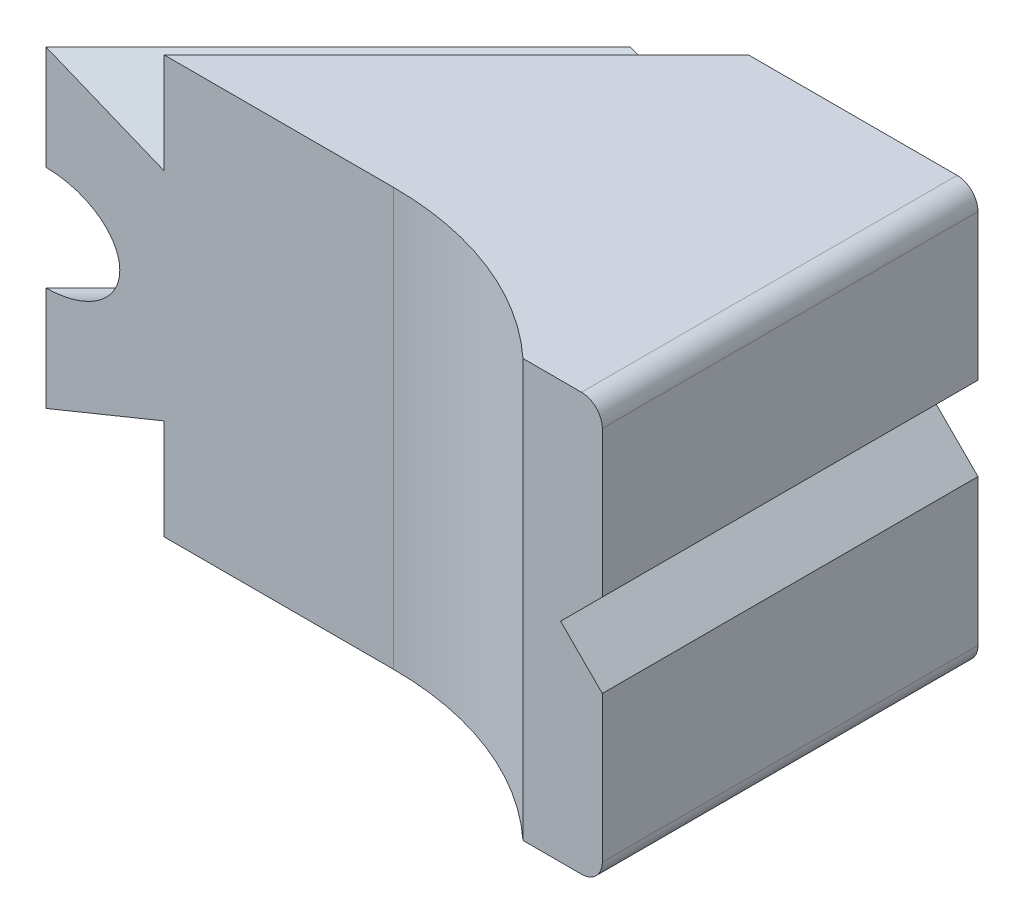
ISO-10303-21;
HEADER;
FILE_DESCRIPTION(('STEP AP214'),'2;1');
FILE_NAME('part.step','',(''),(''),'','','');
FILE_SCHEMA(('AUTOMOTIVE_DESIGN { 1 0 10303 214 1 1 1 1 }'));
ENDSEC;
DATA;
#1=APPLICATION_CONTEXT('core data for automotive mechanical design processes');
#2=APPLICATION_PROTOCOL_DEFINITION('international standard','automotive_design',2000,#1);
#3=PRODUCT_CONTEXT('',#1,'mechanical');
#4=PRODUCT('Part','Part','',(#3));
#5=PRODUCT_RELATED_PRODUCT_CATEGORY('part','',(#4));
#6=PRODUCT_DEFINITION_FORMATION('','',#4);
#7=PRODUCT_DEFINITION_CONTEXT('part definition',#1,'design');
#8=PRODUCT_DEFINITION('design','',#6,#7);
#9=PRODUCT_DEFINITION_SHAPE('','',#8);
#10=(LENGTH_UNIT() NAMED_UNIT(*) SI_UNIT(.MILLI.,.METRE.));
#11=(NAMED_UNIT(*) PLANE_ANGLE_UNIT() SI_UNIT($,.RADIAN.));
#12=(NAMED_UNIT(*) SI_UNIT($,.STERADIAN.) SOLID_ANGLE_UNIT());
#13=UNCERTAINTY_MEASURE_WITH_UNIT(LENGTH_MEASURE(1.E-05),#10,'distance_accuracy_value','');
#14=(GEOMETRIC_REPRESENTATION_CONTEXT(3) GLOBAL_UNCERTAINTY_ASSIGNED_CONTEXT((#13)) GLOBAL_UNIT_ASSIGNED_CONTEXT((#10,
#11,#12)) REPRESENTATION_CONTEXT('',''));
#15=CARTESIAN_POINT('',(0.,0.,0.));
#16=DIRECTION('',(0.,0.,1.));
#17=DIRECTION('',(1.,0.,0.));
#18=AXIS2_PLACEMENT_3D('',#15,#16,#17);
#19=CARTESIAN_POINT('',(33.313708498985,-20.,0.));
#20=DIRECTION('',(1.,0.,0.));
#21=DIRECTION('',(0.,1.,0.));
#22=AXIS2_PLACEMENT_3D('',#19,#20,#21);
#23=PLANE('',#22);
#24=DIRECTION('',(0.,0.,1.));
#25=VECTOR('',#24,1.);
#26=CARTESIAN_POINT('',(33.313708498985,4.,0.));
#27=LINE('',#26,#25);
#28=CARTESIAN_POINT('',(33.313708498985,4.,0.));
#29=VERTEX_POINT('',#28);
#30=CARTESIAN_POINT('',(33.313708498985,4.,36.));
#31=VERTEX_POINT('',#30);
#32=EDGE_CURVE('E332',#29,#31,#27,.T.);
#33=ORIENTED_EDGE('',*,*,#32,.F.);
#34=DIRECTION('',(0.,1.,0.));
#35=VECTOR('',#34,1.);
#36=CARTESIAN_POINT('',(33.313708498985,-20.,0.));
#37=LINE('',#36,#35);
#38=CARTESIAN_POINT('',(33.313708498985,18.,0.));
#39=VERTEX_POINT('',#38);
#40=EDGE_CURVE('E346',#29,#39,#37,.T.);
#41=ORIENTED_EDGE('',*,*,#40,.T.);
#42=DIRECTION('',(0.,0.,1.));
#43=VECTOR('',#42,1.);
#44=CARTESIAN_POINT('',(33.313708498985,18.,36.));
#45=LINE('',#44,#43);
#46=CARTESIAN_POINT('',(33.313708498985,18.,36.));
#47=VERTEX_POINT('',#46);
#48=EDGE_CURVE('E362',#39,#47,#45,.T.);
#49=ORIENTED_EDGE('',*,*,#48,.T.);
#50=DIRECTION('',(0.,-1.,0.));
#51=VECTOR('',#50,1.);
#52=CARTESIAN_POINT('',(33.313708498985,-20.,36.));
#53=LINE('',#52,#51);
#54=EDGE_CURVE('E351',#47,#31,#53,.T.);
#55=ORIENTED_EDGE('',*,*,#54,.T.);
#56=EDGE_LOOP('',(#33,#41,#49,#55));
#57=FACE_BOUND('',#56,.T.);
#58=ADVANCED_FACE('F14',(#57),#23,.T.);
#59=DIRECTION('',(0.,0.,1.));
#60=VECTOR('',#59,1.);
#61=CARTESIAN_POINT('',(33.313708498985,-4.,0.));
#62=LINE('',#61,#60);
#63=CARTESIAN_POINT('',(33.313708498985,-4.,0.));
#64=VERTEX_POINT('',#63);
#65=CARTESIAN_POINT('',(33.313708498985,-4.,36.));
#66=VERTEX_POINT('',#65);
#67=EDGE_CURVE('E333',#64,#66,#62,.T.);
#68=ORIENTED_EDGE('',*,*,#67,.T.);
#69=CARTESIAN_POINT('',(33.313708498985,-18.,36.));
#70=VERTEX_POINT('',#69);
#71=EDGE_CURVE('E350',#66,#70,#53,.T.);
#72=ORIENTED_EDGE('',*,*,#71,.T.);
#73=DIRECTION('',(0.,0.,-1.));
#74=VECTOR('',#73,1.);
#75=CARTESIAN_POINT('',(33.313708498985,-18.,0.));
#76=LINE('',#75,#74);
#77=CARTESIAN_POINT('',(33.313708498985,-18.,0.));
#78=VERTEX_POINT('',#77);
#79=EDGE_CURVE('E365',#70,#78,#76,.T.);
#80=ORIENTED_EDGE('',*,*,#79,.T.);
#81=EDGE_CURVE('E347',#78,#64,#37,.T.);
#82=ORIENTED_EDGE('',*,*,#81,.T.);
#83=EDGE_LOOP('',(#68,#72,#80,#82));
#84=FACE_BOUND('',#83,.T.);
#85=ADVANCED_FACE('F388',(#84),#23,.T.);
#86=CARTESIAN_POINT('',(33.313708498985,-4.,0.));
#87=DIRECTION('',(-0.707106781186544,-0.707106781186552,0.));
#88=DIRECTION('',(0.707106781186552,-0.707106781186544,0.));
#89=AXIS2_PLACEMENT_3D('',#86,#87,#88);
#90=PLANE('',#89);
#91=DIRECTION('',(0.707106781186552,-0.707106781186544,0.));
#92=VECTOR('',#91,1.);
#93=CARTESIAN_POINT('',(33.313708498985,-4.,36.));
#94=LINE('',#93,#92);
#95=CARTESIAN_POINT('',(29.313708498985,0.,36.));
#96=VERTEX_POINT('',#95);
#97=EDGE_CURVE('E326',#96,#66,#94,.T.);
#98=ORIENTED_EDGE('',*,*,#97,.T.);
#99=ORIENTED_EDGE('',*,*,#67,.F.);
#100=DIRECTION('',(0.707106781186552,-0.707106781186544,0.));
#101=VECTOR('',#100,1.);
#102=CARTESIAN_POINT('',(33.313708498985,-4.,0.));
#103=LINE('',#102,#101);
#104=CARTESIAN_POINT('',(29.313708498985,0.,0.));
#105=VERTEX_POINT('',#104);
#106=EDGE_CURVE('E329',#105,#64,#103,.T.);
#107=ORIENTED_EDGE('',*,*,#106,.F.);
#108=DIRECTION('',(0.,0.,1.));
#109=VECTOR('',#108,1.);
#110=CARTESIAN_POINT('',(29.313708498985,0.,0.));
#111=LINE('',#110,#109);
#112=EDGE_CURVE('E337',#105,#96,#111,.T.);
#113=ORIENTED_EDGE('',*,*,#112,.T.);
#114=EDGE_LOOP('',(#98,#99,#107,#113));
#115=FACE_BOUND('',#114,.T.);
#116=ADVANCED_FACE('F395',(#115),#90,.F.);
#117=CARTESIAN_POINT('',(33.313708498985,4.,0.));
#118=DIRECTION('',(-0.707106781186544,0.707106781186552,0.));
#119=DIRECTION('',(-0.707106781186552,-0.707106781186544,0.));
#120=AXIS2_PLACEMENT_3D('',#117,#118,#119);
#121=PLANE('',#120);
#122=DIRECTION('',(-0.707106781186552,-0.707106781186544,0.));
#123=VECTOR('',#122,1.);
#124=CARTESIAN_POINT('',(33.313708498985,4.,36.));
#125=LINE('',#124,#123);
#126=EDGE_CURVE('E323',#31,#96,#125,.T.);
#127=ORIENTED_EDGE('',*,*,#126,.T.);
#128=ORIENTED_EDGE('',*,*,#112,.F.);
#129=DIRECTION('',(-0.707106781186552,-0.707106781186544,0.));
#130=VECTOR('',#129,1.);
#131=CARTESIAN_POINT('',(33.313708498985,4.,0.));
#132=LINE('',#131,#130);
#133=EDGE_CURVE('E29',#29,#105,#132,.T.);
#134=ORIENTED_EDGE('',*,*,#133,.F.);
#135=ORIENTED_EDGE('',*,*,#32,.T.);
#136=EDGE_LOOP('',(#127,#128,#134,#135));
#137=FACE_BOUND('',#136,.T.);
#138=ADVANCED_FACE('F475',(#137),#121,.F.);
#139=CARTESIAN_POINT('',(31.313708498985,-18.,0.));
#140=DIRECTION('',(0.,0.,1.));
#141=DIRECTION('',(0.,-1.,0.));
#142=AXIS2_PLACEMENT_3D('',#139,#140,#141);
#143=CYLINDRICAL_SURFACE('',#142,2.);
#144=CARTESIAN_POINT('',(31.313708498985,-18.,36.));
#145=DIRECTION('',(0.,0.,-1.));
#146=DIRECTION('',(-1.,0.,0.));
#147=AXIS2_PLACEMENT_3D('',#144,#145,#146);
#148=CIRCLE('',#147,2.);
#149=CARTESIAN_POINT('',(31.313708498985,-20.,36.));
#150=VERTEX_POINT('',#149);
#151=EDGE_CURVE('E22',#150,#70,#148,.F.);
#152=ORIENTED_EDGE('',*,*,#151,.F.);
#153=DIRECTION('',(0.,0.,-1.));
#154=VECTOR('',#153,1.);
#155=CARTESIAN_POINT('',(31.313708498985,-20.,36.));
#156=LINE('',#155,#154);
#157=CARTESIAN_POINT('',(31.313708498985,-20.,0.));
#158=VERTEX_POINT('',#157);
#159=EDGE_CURVE('E373',#158,#150,#156,.F.);
#160=ORIENTED_EDGE('',*,*,#159,.F.);
#161=CARTESIAN_POINT('',(31.313708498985,-18.,0.));
#162=DIRECTION('',(0.,0.,1.));
#163=DIRECTION('',(0.,-1.,0.));
#164=AXIS2_PLACEMENT_3D('',#161,#162,#163);
#165=CIRCLE('',#164,2.);
#166=EDGE_CURVE('E371',#78,#158,#165,.F.);
#167=ORIENTED_EDGE('',*,*,#166,.F.);
#168=ORIENTED_EDGE('',*,*,#79,.F.);
#169=EDGE_LOOP('',(#152,#160,#167,#168));
#170=FACE_BOUND('',#169,.T.);
#171=ADVANCED_FACE('F385',(#170),#143,.T.);
#172=CARTESIAN_POINT('',(31.313708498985,18.,0.));
#173=DIRECTION('',(0.,0.,-1.));
#174=DIRECTION('',(0.,1.,0.));
#175=AXIS2_PLACEMENT_3D('',#172,#173,#174);
#176=CYLINDRICAL_SURFACE('',#175,2.);
#177=CARTESIAN_POINT('',(31.313708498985,18.,0.));
#178=DIRECTION('',(0.,0.,1.));
#179=DIRECTION('',(0.,-1.,0.));
#180=AXIS2_PLACEMENT_3D('',#177,#178,#179);
#181=CIRCLE('',#180,2.);
#182=CARTESIAN_POINT('',(31.313708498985,20.,0.));
#183=VERTEX_POINT('',#182);
#184=EDGE_CURVE('E368',#183,#39,#181,.F.);
#185=ORIENTED_EDGE('',*,*,#184,.F.);
#186=DIRECTION('',(0.,0.,1.));
#187=VECTOR('',#186,1.);
#188=CARTESIAN_POINT('',(31.313708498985,20.,0.));
#189=LINE('',#188,#187);
#190=CARTESIAN_POINT('',(31.313708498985,20.,36.));
#191=VERTEX_POINT('',#190);
#192=EDGE_CURVE('E9',#191,#183,#189,.F.);
#193=ORIENTED_EDGE('',*,*,#192,.F.);
#194=CARTESIAN_POINT('',(31.313708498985,18.,36.));
#195=DIRECTION('',(0.,0.,-1.));
#196=DIRECTION('',(-1.,0.,0.));
#197=AXIS2_PLACEMENT_3D('',#194,#195,#196);
#198=CIRCLE('',#197,2.);
#199=EDGE_CURVE('E37',#47,#191,#198,.F.);
#200=ORIENTED_EDGE('',*,*,#199,.F.);
#201=ORIENTED_EDGE('',*,*,#48,.F.);
#202=EDGE_LOOP('',(#185,#193,#200,#201));
#203=FACE_BOUND('',#202,.T.);
#204=ADVANCED_FACE('F401',(#203),#176,.T.);
#205=CARTESIAN_POINT('',(33.313708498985,-20.,36.));
#206=DIRECTION('',(0.,0.,-1.));
#207=DIRECTION('',(-1.,0.,0.));
#208=AXIS2_PLACEMENT_3D('',#205,#206,#207);
#209=PLANE('',#208);
#210=ORIENTED_EDGE('',*,*,#71,.F.);
#211=ORIENTED_EDGE('',*,*,#97,.F.);
#212=ORIENTED_EDGE('',*,*,#126,.F.);
#213=ORIENTED_EDGE('',*,*,#54,.F.);
#214=ORIENTED_EDGE('',*,*,#199,.T.);
#215=DIRECTION('',(-1.,0.,0.));
#216=VECTOR('',#215,1.);
#217=CARTESIAN_POINT('',(33.313708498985,20.,36.));
#218=LINE('',#217,#216);
#219=CARTESIAN_POINT('',(25.7097865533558,20.,36.));
#220=VERTEX_POINT('',#219);
#221=EDGE_CURVE('E356',#191,#220,#218,.T.);
#222=ORIENTED_EDGE('',*,*,#221,.T.);
#223=DIRECTION('',(0.,1.,0.));
#224=VECTOR('',#223,1.);
#225=CARTESIAN_POINT('',(25.7097865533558,-20.,36.));
#226=LINE('',#225,#224);
#227=CARTESIAN_POINT('',(25.7097865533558,-20.,36.));
#228=VERTEX_POINT('',#227);
#229=EDGE_CURVE('E343',#228,#220,#226,.T.);
#230=ORIENTED_EDGE('',*,*,#229,.F.);
#231=DIRECTION('',(-1.,0.,0.));
#232=VECTOR('',#231,1.);
#233=CARTESIAN_POINT('',(33.313708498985,-20.,36.));
#234=LINE('',#233,#232);
#235=EDGE_CURVE('E354',#150,#228,#234,.T.);
#236=ORIENTED_EDGE('',*,*,#235,.F.);
#237=ORIENTED_EDGE('',*,*,#151,.T.);
#238=EDGE_LOOP('',(#210,#211,#212,#213,#214,#222,#230,#236,#237));
#239=FACE_BOUND('',#238,.T.);
#240=ADVANCED_FACE('F380',(#239),#209,.F.);
#241=CARTESIAN_POINT('',(5.31370849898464,-20.,58.));
#242=DIRECTION('',(0.,1.,0.));
#243=DIRECTION('',(-1.,0.,0.));
#244=AXIS2_PLACEMENT_3D('',#241,#242,#243);
#245=CYLINDRICAL_SURFACE('',#244,30.);
#246=CARTESIAN_POINT('',(5.31370849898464,20.,58.));
#247=DIRECTION('',(0.,1.,0.));
#248=DIRECTION('',(-1.,0.,0.));
#249=AXIS2_PLACEMENT_3D('',#246,#247,#248);
#250=CIRCLE('',#249,30.);
#251=CARTESIAN_POINT('',(5.31370849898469,20.,28.));
#252=VERTEX_POINT('',#251);
#253=EDGE_CURVE('E336',#220,#252,#250,.T.);
#254=ORIENTED_EDGE('',*,*,#253,.T.);
#255=DIRECTION('',(0.,-1.,0.));
#256=VECTOR('',#255,1.);
#257=CARTESIAN_POINT('',(5.31370849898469,33.3333904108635,28.));
#258=LINE('',#257,#256);
#259=CARTESIAN_POINT('',(5.31370849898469,-20.,28.));
#260=VERTEX_POINT('',#259);
#261=EDGE_CURVE('E246',#252,#260,#258,.T.);
#262=ORIENTED_EDGE('',*,*,#261,.T.);
#263=CARTESIAN_POINT('',(5.31370849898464,-20.,58.));
#264=DIRECTION('',(0.,1.,0.));
#265=DIRECTION('',(-1.,0.,0.));
#266=AXIS2_PLACEMENT_3D('',#263,#264,#265);
#267=CIRCLE('',#266,30.);
#268=EDGE_CURVE('E341',#228,#260,#267,.T.);
#269=ORIENTED_EDGE('',*,*,#268,.F.);
#270=ORIENTED_EDGE('',*,*,#229,.T.);
#271=EDGE_LOOP('',(#254,#262,#269,#270));
#272=FACE_BOUND('',#271,.T.);
#273=ADVANCED_FACE('F442',(#272),#245,.F.);
#274=CARTESIAN_POINT('',(33.313708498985,20.,36.));
#275=DIRECTION('',(0.,-1.,0.));
#276=DIRECTION('',(0.,0.,-1.));
#277=AXIS2_PLACEMENT_3D('',#274,#275,#276);
#278=PLANE('',#277);
#279=ORIENTED_EDGE('',*,*,#221,.F.);
#280=ORIENTED_EDGE('',*,*,#192,.T.);
#281=DIRECTION('',(-1.,0.,0.));
#282=VECTOR('',#281,1.);
#283=CARTESIAN_POINT('',(33.313708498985,20.,0.));
#284=LINE('',#283,#282);
#285=CARTESIAN_POINT('',(11.313708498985,20.,0.));
#286=VERTEX_POINT('',#285);
#287=EDGE_CURVE('E358',#183,#286,#284,.T.);
#288=ORIENTED_EDGE('',*,*,#287,.T.);
#289=DIRECTION('',(0.707106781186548,0.,-0.707106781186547));
#290=VECTOR('',#289,1.);
#291=CARTESIAN_POINT('',(2.65685424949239,20.,8.65685424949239));
#292=LINE('',#291,#290);
#293=CARTESIAN_POINT('',(-16.6862915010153,20.,28.));
#294=VERTEX_POINT('',#293);
#295=EDGE_CURVE('E311',#294,#286,#292,.T.);
#296=ORIENTED_EDGE('',*,*,#295,.F.);
#297=DIRECTION('',(1.,0.,0.));
#298=VECTOR('',#297,1.);
#299=CARTESIAN_POINT('',(22.,20.,28.));
#300=LINE('',#299,#298);
#301=EDGE_CURVE('E293',#294,#252,#300,.T.);
#302=ORIENTED_EDGE('',*,*,#301,.T.);
#303=ORIENTED_EDGE('',*,*,#253,.F.);
#304=EDGE_LOOP('',(#279,#280,#288,#296,#302,#303));
#305=FACE_BOUND('',#304,.T.);
#306=ADVANCED_FACE('F405',(#305),#278,.F.);
#307=CARTESIAN_POINT('',(33.313708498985,-20.,36.));
#308=DIRECTION('',(0.,1.,0.));
#309=DIRECTION('',(0.,0.,1.));
#310=AXIS2_PLACEMENT_3D('',#307,#308,#309);
#311=PLANE('',#310);
#312=DIRECTION('',(-1.,0.,0.));
#313=VECTOR('',#312,1.);
#314=CARTESIAN_POINT('',(33.313708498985,-20.,0.));
#315=LINE('',#314,#313);
#316=CARTESIAN_POINT('',(11.313708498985,-20.,0.));
#317=VERTEX_POINT('',#316);
#318=EDGE_CURVE('E360',#158,#317,#315,.T.);
#319=ORIENTED_EDGE('',*,*,#318,.F.);
#320=ORIENTED_EDGE('',*,*,#159,.T.);
#321=ORIENTED_EDGE('',*,*,#235,.T.);
#322=ORIENTED_EDGE('',*,*,#268,.T.);
#323=DIRECTION('',(1.,0.,0.));
#324=VECTOR('',#323,1.);
#325=CARTESIAN_POINT('',(22.,-20.,28.));
#326=LINE('',#325,#324);
#327=CARTESIAN_POINT('',(-16.6862915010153,-20.,28.));
#328=VERTEX_POINT('',#327);
#329=EDGE_CURVE('E290',#328,#260,#326,.T.);
#330=ORIENTED_EDGE('',*,*,#329,.F.);
#331=DIRECTION('',(0.707106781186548,0.,-0.707106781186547));
#332=VECTOR('',#331,1.);
#333=CARTESIAN_POINT('',(2.65685424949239,-20.,8.65685424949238));
#334=LINE('',#333,#332);
#335=EDGE_CURVE('E317',#328,#317,#334,.T.);
#336=ORIENTED_EDGE('',*,*,#335,.T.);
#337=EDGE_LOOP('',(#319,#320,#321,#322,#330,#336));
#338=FACE_BOUND('',#337,.T.);
#339=ADVANCED_FACE('F16',(#338),#311,.F.);
#340=CARTESIAN_POINT('',(33.313708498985,-20.,0.));
#341=DIRECTION('',(0.,0.,1.));
#342=DIRECTION('',(0.,-1.,0.));
#343=AXIS2_PLACEMENT_3D('',#340,#341,#342);
#344=PLANE('',#343);
#345=ORIENTED_EDGE('',*,*,#133,.T.);
#346=ORIENTED_EDGE('',*,*,#106,.T.);
#347=ORIENTED_EDGE('',*,*,#81,.F.);
#348=ORIENTED_EDGE('',*,*,#166,.T.);
#349=ORIENTED_EDGE('',*,*,#318,.T.);
#350=DIRECTION('',(0.,1.,0.));
#351=VECTOR('',#350,1.);
#352=CARTESIAN_POINT('',(11.313708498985,20.,0.));
#353=LINE('',#352,#351);
#354=CARTESIAN_POINT('',(11.313708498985,-10.3811978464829,0.));
#355=VERTEX_POINT('',#354);
#356=EDGE_CURVE('E253',#317,#355,#353,.T.);
#357=ORIENTED_EDGE('',*,*,#356,.T.);
#358=DIRECTION('',(-0.92582009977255,-0.377964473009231,0.));
#359=VECTOR('',#358,1.);
#360=CARTESIAN_POINT('',(-11.752551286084,-19.7979589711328,0.));
#361=LINE('',#360,#359);
#362=CARTESIAN_POINT('',(0.,-15.,0.));
#363=VERTEX_POINT('',#362);
#364=EDGE_CURVE('E320',#355,#363,#361,.T.);
#365=ORIENTED_EDGE('',*,*,#364,.T.);
#366=DIRECTION('',(0.,1.,0.));
#367=VECTOR('',#366,1.);
#368=CARTESIAN_POINT('',(1.89084858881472E-13,-20.,0.));
#369=LINE('',#368,#367);
#370=CARTESIAN_POINT('',(0.,15.,0.));
#371=VERTEX_POINT('',#370);
#372=EDGE_CURVE('E288',#363,#371,#369,.T.);
#373=ORIENTED_EDGE('',*,*,#372,.T.);
#374=DIRECTION('',(0.92582009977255,-0.377964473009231,0.));
#375=VECTOR('',#374,1.);
#376=CARTESIAN_POINT('',(-25.7496355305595,25.5122446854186,0.));
#377=LINE('',#376,#375);
#378=CARTESIAN_POINT('',(11.313708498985,10.3811978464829,0.));
#379=VERTEX_POINT('',#378);
#380=EDGE_CURVE('E314',#371,#379,#377,.T.);
#381=ORIENTED_EDGE('',*,*,#380,.T.);
#382=DIRECTION('',(0.,1.,0.));
#383=VECTOR('',#382,1.);
#384=CARTESIAN_POINT('',(11.313708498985,20.,0.));
#385=LINE('',#384,#383);
#386=EDGE_CURVE('E268',#379,#286,#385,.T.);
#387=ORIENTED_EDGE('',*,*,#386,.T.);
#388=ORIENTED_EDGE('',*,*,#287,.F.);
#389=ORIENTED_EDGE('',*,*,#184,.T.);
#390=ORIENTED_EDGE('',*,*,#40,.F.);
#391=EDGE_LOOP('',(#345,#346,#347,#348,#349,#357,#365,#373,#381,#387,#388,#389,#390));
#392=FACE_BOUND('',#391,.T.);
#393=ADVANCED_FACE('F390',(#392),#344,.F.);
#394=CARTESIAN_POINT('',(-12.3348685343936,6.39977546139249,16.0879669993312));
#395=DIRECTION('',(0.707106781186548,0.,-0.707106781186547));
#396=DIRECTION('',(0.270856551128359,0.923728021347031,0.270856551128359));
#397=AXIS2_PLACEMENT_3D('',#394,#395,#396);
#398=PLANE('',#397);
#399=DIRECTION('',(-0.561155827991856,-0.6084474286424,-0.561155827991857));
#400=VECTOR('',#399,1.);
#401=CARTESIAN_POINT('',(-14.579491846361,3.96598574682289,13.8433436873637));
#402=LINE('',#401,#400);
#403=CARTESIAN_POINT('',(-14.579491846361,3.96598574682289,13.8433436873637));
#404=VERTEX_POINT('',#403);
#405=CARTESIAN_POINT('',(-16.8241151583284,1.53219603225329,11.5987203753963));
#406=VERTEX_POINT('',#405);
#407=EDGE_CURVE('E217',#404,#406,#402,.T.);
#408=ORIENTED_EDGE('',*,*,#407,.T.);
#409=DIRECTION('',(0.0920185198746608,-0.991496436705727,0.0920185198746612));
#410=VECTOR('',#409,1.);
#411=CARTESIAN_POINT('',(-16.8241151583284,1.53219603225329,11.5987203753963));
#412=LINE('',#411,#410);
#413=CARTESIAN_POINT('',(-16.4560410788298,-2.43378971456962,11.966794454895));
#414=VERTEX_POINT('',#413);
#415=EDGE_CURVE('E220',#406,#414,#412,.T.);
#416=ORIENTED_EDGE('',*,*,#415,.T.);
#417=DIRECTION('',(0.653174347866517,-0.383049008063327,0.653174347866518));
#418=VECTOR('',#417,1.);
#419=CARTESIAN_POINT('',(-16.4560410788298,-2.43378971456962,11.966794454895));
#420=LINE('',#419,#418);
#421=CARTESIAN_POINT('',(-13.8433436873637,-3.96598574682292,14.579491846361));
#422=VERTEX_POINT('',#421);
#423=EDGE_CURVE('E187',#414,#422,#420,.T.);
#424=ORIENTED_EDGE('',*,*,#423,.T.);
#425=DIRECTION('',(0.561155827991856,0.6084474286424,0.561155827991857));
#426=VECTOR('',#425,1.);
#427=CARTESIAN_POINT('',(-13.8433436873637,-3.96598574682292,14.579491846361));
#428=LINE('',#427,#426);
#429=CARTESIAN_POINT('',(-11.5987203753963,-1.53219603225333,16.8241151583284));
#430=VERTEX_POINT('',#429);
#431=EDGE_CURVE('E223',#422,#430,#428,.T.);
#432=ORIENTED_EDGE('',*,*,#431,.T.);
#433=DIRECTION('',(-0.092018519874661,0.991496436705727,-0.0920185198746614));
#434=VECTOR('',#433,1.);
#435=CARTESIAN_POINT('',(-11.5987203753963,-1.53219603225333,16.8241151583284));
#436=LINE('',#435,#434);
#437=CARTESIAN_POINT('',(-11.9667944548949,2.43378971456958,16.4560410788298));
#438=VERTEX_POINT('',#437);
#439=EDGE_CURVE('E226',#430,#438,#436,.T.);
#440=ORIENTED_EDGE('',*,*,#439,.T.);
#441=DIRECTION('',(-0.653174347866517,0.383049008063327,-0.653174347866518));
#442=VECTOR('',#441,1.);
#443=CARTESIAN_POINT('',(-11.9667944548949,2.43378971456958,16.4560410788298));
#444=LINE('',#443,#442);
#445=EDGE_CURVE('E229',#438,#404,#444,.T.);
#446=ORIENTED_EDGE('',*,*,#445,.T.);
#447=EDGE_LOOP('',(#408,#416,#424,#432,#440,#446));
#448=FACE_BOUND('',#447,.T.);
#449=ADVANCED_FACE('F569',(#448),#398,.F.);
#450=CARTESIAN_POINT('',(-16.8241151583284,1.53219603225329,11.5987203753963));
#451=DIRECTION('',(-0.701093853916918,-0.130133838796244,-0.701093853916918));
#452=DIRECTION('',(0.0920185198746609,-0.991496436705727,0.0920185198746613));
#453=AXIS2_PLACEMENT_3D('',#450,#451,#452);
#454=PLANE('',#453);
#455=DIRECTION('',(0.0920185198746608,-0.991496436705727,0.0920185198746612));
#456=VECTOR('',#455,1.);
#457=CARTESIAN_POINT('',(-22.4809694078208,1.53219603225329,17.2555746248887));
#458=LINE('',#457,#456);
#459=CARTESIAN_POINT('',(-22.4809694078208,1.53219603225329,17.2555746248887));
#460=VERTEX_POINT('',#459);
#461=CARTESIAN_POINT('',(-22.1128953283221,-2.43378971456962,17.6236487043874));
#462=VERTEX_POINT('',#461);
#463=EDGE_CURVE('E196',#460,#462,#458,.T.);
#464=ORIENTED_EDGE('',*,*,#463,.T.);
#465=DIRECTION('',(-0.707106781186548,0.,0.707106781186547));
#466=VECTOR('',#465,1.);
#467=CARTESIAN_POINT('',(-16.4560410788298,-2.43378971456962,11.966794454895));
#468=LINE('',#467,#466);
#469=EDGE_CURVE('E180',#414,#462,#468,.T.);
#470=ORIENTED_EDGE('',*,*,#469,.F.);
#471=ORIENTED_EDGE('',*,*,#415,.F.);
#472=DIRECTION('',(-0.707106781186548,0.,0.707106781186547));
#473=VECTOR('',#472,1.);
#474=CARTESIAN_POINT('',(-16.8241151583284,1.53219603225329,11.5987203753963));
#475=LINE('',#474,#473);
#476=EDGE_CURVE('E192',#406,#460,#475,.T.);
#477=ORIENTED_EDGE('',*,*,#476,.T.);
#478=EDGE_LOOP('',(#464,#470,#471,#477));
#479=FACE_BOUND('',#478,.T.);
#480=ADVANCED_FACE('F197',(#479),#454,.F.);
#481=CARTESIAN_POINT('',(-16.4560410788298,-2.43378971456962,11.966794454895));
#482=DIRECTION('',(-0.270856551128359,-0.923728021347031,-0.270856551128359));
#483=DIRECTION('',(0.653174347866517,-0.383049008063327,0.653174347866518));
#484=AXIS2_PLACEMENT_3D('',#481,#482,#483);
#485=PLANE('',#484);
#486=DIRECTION('',(0.653174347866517,-0.383049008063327,0.653174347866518));
#487=VECTOR('',#486,1.);
#488=CARTESIAN_POINT('',(-22.1128953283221,-2.43378971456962,17.6236487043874));
#489=LINE('',#488,#487);
#490=CARTESIAN_POINT('',(-19.5001979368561,-3.96598574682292,20.2363460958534));
#491=VERTEX_POINT('',#490);
#492=EDGE_CURVE('E184',#462,#491,#489,.T.);
#493=ORIENTED_EDGE('',*,*,#492,.T.);
#494=DIRECTION('',(-0.707106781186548,0.,0.707106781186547));
#495=VECTOR('',#494,1.);
#496=CARTESIAN_POINT('',(-13.8433436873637,-3.96598574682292,14.579491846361));
#497=LINE('',#496,#495);
#498=EDGE_CURVE('E191',#422,#491,#497,.T.);
#499=ORIENTED_EDGE('',*,*,#498,.F.);
#500=ORIENTED_EDGE('',*,*,#423,.F.);
#501=ORIENTED_EDGE('',*,*,#469,.T.);
#502=EDGE_LOOP('',(#493,#499,#500,#501));
#503=FACE_BOUND('',#502,.T.);
#504=ADVANCED_FACE('F182',(#503),#485,.F.);
#505=CARTESIAN_POINT('',(-13.8433436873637,-3.96598574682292,14.579491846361));
#506=DIRECTION('',(0.430237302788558,-0.793594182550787,0.430237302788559));
#507=DIRECTION('',(0.561155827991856,0.6084474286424,0.561155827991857));
#508=AXIS2_PLACEMENT_3D('',#505,#506,#507);
#509=PLANE('',#508);
#510=DIRECTION('',(0.561155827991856,0.6084474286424,0.561155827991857));
#511=VECTOR('',#510,1.);
#512=CARTESIAN_POINT('',(-19.5001979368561,-3.96598574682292,20.2363460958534));
#513=LINE('',#512,#511);
#514=CARTESIAN_POINT('',(-17.2555746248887,-1.53219603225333,22.4809694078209));
#515=VERTEX_POINT('',#514);
#516=EDGE_CURVE('E206',#491,#515,#513,.T.);
#517=ORIENTED_EDGE('',*,*,#516,.T.);
#518=DIRECTION('',(-0.707106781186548,0.,0.707106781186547));
#519=VECTOR('',#518,1.);
#520=CARTESIAN_POINT('',(-11.5987203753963,-1.53219603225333,16.8241151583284));
#521=LINE('',#520,#519);
#522=EDGE_CURVE('E237',#430,#515,#521,.T.);
#523=ORIENTED_EDGE('',*,*,#522,.F.);
#524=ORIENTED_EDGE('',*,*,#431,.F.);
#525=ORIENTED_EDGE('',*,*,#498,.T.);
#526=EDGE_LOOP('',(#517,#523,#524,#525));
#527=FACE_BOUND('',#526,.T.);
#528=ADVANCED_FACE('F629',(#527),#509,.F.);
#529=CARTESIAN_POINT('',(-11.5987203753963,-1.53219603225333,16.8241151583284));
#530=DIRECTION('',(0.701093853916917,0.130133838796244,0.701093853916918));
#531=DIRECTION('',(-0.092018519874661,0.991496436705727,-0.0920185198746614));
#532=AXIS2_PLACEMENT_3D('',#529,#530,#531);
#533=PLANE('',#532);
#534=DIRECTION('',(-0.092018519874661,0.991496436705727,-0.0920185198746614));
#535=VECTOR('',#534,1.);
#536=CARTESIAN_POINT('',(-17.2555746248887,-1.53219603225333,22.4809694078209));
#537=LINE('',#536,#535);
#538=CARTESIAN_POINT('',(-17.6236487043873,2.43378971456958,22.1128953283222));
#539=VERTEX_POINT('',#538);
#540=EDGE_CURVE('E208',#515,#539,#537,.T.);
#541=ORIENTED_EDGE('',*,*,#540,.T.);
#542=DIRECTION('',(-0.707106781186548,0.,0.707106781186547));
#543=VECTOR('',#542,1.);
#544=CARTESIAN_POINT('',(-11.9667944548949,2.43378971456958,16.4560410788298));
#545=LINE('',#544,#543);
#546=EDGE_CURVE('E235',#438,#539,#545,.T.);
#547=ORIENTED_EDGE('',*,*,#546,.F.);
#548=ORIENTED_EDGE('',*,*,#439,.F.);
#549=ORIENTED_EDGE('',*,*,#522,.T.);
#550=EDGE_LOOP('',(#541,#547,#548,#549));
#551=FACE_BOUND('',#550,.T.);
#552=ADVANCED_FACE('F619',(#551),#533,.F.);
#553=CARTESIAN_POINT('',(-11.9667944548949,2.43378971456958,16.4560410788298));
#554=DIRECTION('',(0.270856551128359,0.923728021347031,0.270856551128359));
#555=DIRECTION('',(-0.707106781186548,0.,0.707106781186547));
#556=AXIS2_PLACEMENT_3D('',#553,#554,#555);
#557=PLANE('',#556);
#558=DIRECTION('',(-0.653174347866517,0.383049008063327,-0.653174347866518));
#559=VECTOR('',#558,1.);
#560=CARTESIAN_POINT('',(-17.6236487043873,2.43378971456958,22.1128953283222));
#561=LINE('',#560,#559);
#562=CARTESIAN_POINT('',(-20.2363460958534,3.96598574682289,19.5001979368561));
#563=VERTEX_POINT('',#562);
#564=EDGE_CURVE('E214',#539,#563,#561,.T.);
#565=ORIENTED_EDGE('',*,*,#564,.T.);
#566=DIRECTION('',(-0.707106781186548,0.,0.707106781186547));
#567=VECTOR('',#566,1.);
#568=CARTESIAN_POINT('',(-14.579491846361,3.96598574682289,13.8433436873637));
#569=LINE('',#568,#567);
#570=EDGE_CURVE('E232',#404,#563,#569,.T.);
#571=ORIENTED_EDGE('',*,*,#570,.F.);
#572=ORIENTED_EDGE('',*,*,#445,.F.);
#573=ORIENTED_EDGE('',*,*,#546,.T.);
#574=EDGE_LOOP('',(#565,#571,#572,#573));
#575=FACE_BOUND('',#574,.T.);
#576=ADVANCED_FACE('F609',(#575),#557,.F.);
#577=CARTESIAN_POINT('',(-14.579491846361,3.96598574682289,13.8433436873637));
#578=DIRECTION('',(-0.430237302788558,0.793594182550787,-0.430237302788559));
#579=DIRECTION('',(-0.561155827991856,-0.6084474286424,-0.561155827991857));
#580=AXIS2_PLACEMENT_3D('',#577,#578,#579);
#581=PLANE('',#580);
#582=DIRECTION('',(-0.561155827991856,-0.6084474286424,-0.561155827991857));
#583=VECTOR('',#582,1.);
#584=CARTESIAN_POINT('',(-20.2363460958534,3.96598574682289,19.5001979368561));
#585=LINE('',#584,#583);
#586=EDGE_CURVE('E200',#563,#460,#585,.T.);
#587=ORIENTED_EDGE('',*,*,#586,.T.);
#588=ORIENTED_EDGE('',*,*,#476,.F.);
#589=ORIENTED_EDGE('',*,*,#407,.F.);
#590=ORIENTED_EDGE('',*,*,#570,.T.);
#591=EDGE_LOOP('',(#587,#588,#589,#590));
#592=FACE_BOUND('',#591,.T.);
#593=ADVANCED_FACE('F592',(#592),#581,.F.);
#594=CARTESIAN_POINT('',(-5.72613639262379,0.,5.72613639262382));
#595=DIRECTION('',(-0.707106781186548,0.,0.707106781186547));
#596=DIRECTION('',(-0.270856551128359,-0.923728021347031,-0.270856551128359));
#597=AXIS2_PLACEMENT_3D('',#594,#595,#596);
#598=PLANE('',#597);
#599=CARTESIAN_POINT('',(-5.72613639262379,0.,5.72613639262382));
#600=DIRECTION('',(-0.707106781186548,0.,0.707106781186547));
#601=DIRECTION('',(-0.270856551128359,-0.923728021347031,-0.270856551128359));
#602=AXIS2_PLACEMENT_3D('',#599,#600,#601);
#603=CIRCLE('',#602,9.);
#604=CARTESIAN_POINT('',(-5.72613639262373,9.,5.72613639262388));
#605=VERTEX_POINT('',#604);
#606=CARTESIAN_POINT('',(-5.72613639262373,-9.,5.72613639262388));
#607=VERTEX_POINT('',#606);
#608=EDGE_CURVE('E234',#605,#607,#603,.T.);
#609=ORIENTED_EDGE('',*,*,#608,.F.);
#610=DIRECTION('',(0.,-1.,0.));
#611=VECTOR('',#610,1.);
#612=CARTESIAN_POINT('',(-5.72613639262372,-20.,5.72613639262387));
#613=LINE('',#612,#611);
#614=EDGE_CURVE('E307',#605,#607,#613,.T.);
#615=ORIENTED_EDGE('',*,*,#614,.T.);
#616=EDGE_LOOP('',(#609,#615));
#617=FACE_BOUND('',#616,.T.);
#618=ADVANCED_FACE('F470',(#617),#598,.F.);
#619=CARTESIAN_POINT('',(-19.8682720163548,0.,19.8682720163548));
#620=DIRECTION('',(0.707106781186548,0.,-0.707106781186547));
#621=DIRECTION('',(0.270856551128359,0.923728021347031,0.270856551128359));
#622=AXIS2_PLACEMENT_3D('',#619,#620,#621);
#623=CYLINDRICAL_SURFACE('',#622,9.);
#624=DIRECTION('',(-0.707106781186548,0.,0.707106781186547));
#625=VECTOR('',#624,1.);
#626=CARTESIAN_POINT('',(-5.72613639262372,-9.,5.72613639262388));
#627=LINE('',#626,#625);
#628=CARTESIAN_POINT('',(-19.8682720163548,-9.,19.8682720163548));
#629=VERTEX_POINT('',#628);
#630=EDGE_CURVE('E304',#629,#607,#627,.F.);
#631=ORIENTED_EDGE('',*,*,#630,.F.);
#632=CARTESIAN_POINT('',(-19.8682720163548,0.,19.8682720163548));
#633=DIRECTION('',(-0.707106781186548,0.,0.707106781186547));
#634=DIRECTION('',(-0.270856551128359,-0.923728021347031,-0.270856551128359));
#635=AXIS2_PLACEMENT_3D('',#632,#633,#634);
#636=CIRCLE('',#635,9.);
#637=CARTESIAN_POINT('',(-19.8682720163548,9.,19.8682720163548));
#638=VERTEX_POINT('',#637);
#639=EDGE_CURVE('E243',#638,#629,#636,.T.);
#640=ORIENTED_EDGE('',*,*,#639,.F.);
#641=DIRECTION('',(-0.707106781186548,0.,0.707106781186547));
#642=VECTOR('',#641,1.);
#643=CARTESIAN_POINT('',(-5.72613639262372,9.,5.72613639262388));
#644=LINE('',#643,#642);
#645=EDGE_CURVE('E309',#605,#638,#644,.T.);
#646=ORIENTED_EDGE('',*,*,#645,.F.);
#647=ORIENTED_EDGE('',*,*,#608,.T.);
#648=EDGE_LOOP('',(#631,#640,#646,#647));
#649=FACE_BOUND('',#648,.T.);
#650=ADVANCED_FACE('F581',(#649),#623,.T.);
#651=CARTESIAN_POINT('',(-19.8682720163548,0.,19.8682720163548));
#652=DIRECTION('',(-0.707106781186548,0.,0.707106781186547));
#653=DIRECTION('',(-0.270856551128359,-0.923728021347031,-0.270856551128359));
#654=AXIS2_PLACEMENT_3D('',#651,#652,#653);
#655=PLANE('',#654);
#656=ORIENTED_EDGE('',*,*,#586,.F.);
#657=ORIENTED_EDGE('',*,*,#564,.F.);
#658=ORIENTED_EDGE('',*,*,#540,.F.);
#659=ORIENTED_EDGE('',*,*,#516,.F.);
#660=ORIENTED_EDGE('',*,*,#492,.F.);
#661=ORIENTED_EDGE('',*,*,#463,.F.);
#662=EDGE_LOOP('',(#656,#657,#658,#659,#660,#661));
#663=FACE_BOUND('',#662,.T.);
#664=DIRECTION('',(0.,-1.,0.));
#665=VECTOR('',#664,1.);
#666=CARTESIAN_POINT('',(-19.8682720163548,-20.,19.8682720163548));
#667=LINE('',#666,#665);
#668=CARTESIAN_POINT('',(-19.8682720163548,-5.,19.8682720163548));
#669=VERTEX_POINT('',#668);
#670=EDGE_CURVE('E278',#669,#629,#667,.T.);
#671=ORIENTED_EDGE('',*,*,#670,.F.);
#672=CARTESIAN_POINT('',(-19.8682720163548,0.,19.8682720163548));
#673=DIRECTION('',(-0.707106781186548,0.,0.707106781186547));
#674=DIRECTION('',(0.707106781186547,0.,0.707106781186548));
#675=AXIS2_PLACEMENT_3D('',#672,#673,#674);
#676=CIRCLE('',#675,5.);
#677=CARTESIAN_POINT('',(-19.8682720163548,5.,19.8682720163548));
#678=VERTEX_POINT('',#677);
#679=EDGE_CURVE('E282',#669,#678,#676,.T.);
#680=ORIENTED_EDGE('',*,*,#679,.T.);
#681=EDGE_CURVE('E281',#638,#678,#667,.T.);
#682=ORIENTED_EDGE('',*,*,#681,.F.);
#683=ORIENTED_EDGE('',*,*,#639,.T.);
#684=EDGE_LOOP('',(#671,#680,#682,#683));
#685=FACE_BOUND('',#684,.T.);
#686=ADVANCED_FACE('F202',(#663,#685),#655,.T.);
#687=CARTESIAN_POINT('',(-28.,0.,28.));
#688=DIRECTION('',(0.707106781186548,0.,-0.707106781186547));
#689=DIRECTION('',(-0.707106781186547,0.,-0.707106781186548));
#690=AXIS2_PLACEMENT_3D('',#687,#688,#689);
#691=CYLINDRICAL_SURFACE('',#690,5.);
#692=DIRECTION('',(0.707106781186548,0.,-0.707106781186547));
#693=VECTOR('',#692,1.);
#694=CARTESIAN_POINT('',(-28.,-5.,28.));
#695=LINE('',#694,#693);
#696=CARTESIAN_POINT('',(-28.,-5.,28.));
#697=VERTEX_POINT('',#696);
#698=EDGE_CURVE('E302',#669,#697,#695,.F.);
#699=ORIENTED_EDGE('',*,*,#698,.T.);
#700=CARTESIAN_POINT('',(-28.,0.,28.));
#701=DIRECTION('',(0.,0.,-1.));
#702=DIRECTION('',(1.,0.,0.));
#703=AXIS2_PLACEMENT_3D('',#700,#701,#702);
#704=ELLIPSE('',#703,7.07106781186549,5.);
#705=CARTESIAN_POINT('',(-28.,5.,28.));
#706=VERTEX_POINT('',#705);
#707=EDGE_CURVE('E285',#697,#706,#704,.F.);
#708=ORIENTED_EDGE('',*,*,#707,.T.);
#709=DIRECTION('',(0.707106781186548,0.,-0.707106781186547));
#710=VECTOR('',#709,1.);
#711=CARTESIAN_POINT('',(-28.,5.,28.));
#712=LINE('',#711,#710);
#713=EDGE_CURVE('E299',#706,#678,#712,.T.);
#714=ORIENTED_EDGE('',*,*,#713,.T.);
#715=ORIENTED_EDGE('',*,*,#679,.F.);
#716=EDGE_LOOP('',(#699,#708,#714,#715));
#717=FACE_BOUND('',#716,.T.);
#718=ADVANCED_FACE('F427',(#717),#691,.F.);
#719=CARTESIAN_POINT('',(16.6568542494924,10.3811978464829,-5.34314575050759));
#720=DIRECTION('',(-0.353553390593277,-0.866025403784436,-0.353553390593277));
#721=DIRECTION('',(0.,-0.377964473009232,0.92582009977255));
#722=AXIS2_PLACEMENT_3D('',#719,#720,#721);
#723=PLANE('',#722);
#724=DIRECTION('',(-0.707106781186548,0.,0.707106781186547));
#725=VECTOR('',#724,1.);
#726=CARTESIAN_POINT('',(16.6568542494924,10.3811978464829,-5.34314575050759));
#727=LINE('',#726,#725);
#728=CARTESIAN_POINT('',(-16.6862915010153,10.3811978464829,28.));
#729=VERTEX_POINT('',#728);
#730=EDGE_CURVE('E265',#379,#729,#727,.T.);
#731=ORIENTED_EDGE('',*,*,#730,.F.);
#732=ORIENTED_EDGE('',*,*,#380,.F.);
#733=DIRECTION('',(-0.707106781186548,0.,0.707106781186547));
#734=VECTOR('',#733,1.);
#735=CARTESIAN_POINT('',(11.,15.,-11.));
#736=LINE('',#735,#734);
#737=CARTESIAN_POINT('',(-28.,15.,28.));
#738=VERTEX_POINT('',#737);
#739=EDGE_CURVE('E264',#371,#738,#736,.T.);
#740=ORIENTED_EDGE('',*,*,#739,.T.);
#741=DIRECTION('',(-0.92582009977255,0.377964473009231,0.));
#742=VECTOR('',#741,1.);
#743=CARTESIAN_POINT('',(13.1075073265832,-1.78206959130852,28.));
#744=LINE('',#743,#742);
#745=EDGE_CURVE('E275',#729,#738,#744,.T.);
#746=ORIENTED_EDGE('',*,*,#745,.F.);
#747=EDGE_LOOP('',(#731,#732,#740,#746));
#748=FACE_BOUND('',#747,.T.);
#749=ADVANCED_FACE('F413',(#748),#723,.F.);
#750=CARTESIAN_POINT('',(-28.,-20.,28.));
#751=DIRECTION('',(0.707106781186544,0.,0.707106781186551));
#752=DIRECTION('',(0.707106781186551,0.,-0.707106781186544));
#753=AXIS2_PLACEMENT_3D('',#750,#751,#752);
#754=PLANE('',#753);
#755=ORIENTED_EDGE('',*,*,#372,.F.);
#756=DIRECTION('',(-0.707106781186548,0.,0.707106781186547));
#757=VECTOR('',#756,1.);
#758=CARTESIAN_POINT('',(11.,-15.,-11.));
#759=LINE('',#758,#757);
#760=CARTESIAN_POINT('',(-28.,-15.,28.));
#761=VERTEX_POINT('',#760);
#762=EDGE_CURVE('E250',#363,#761,#759,.T.);
#763=ORIENTED_EDGE('',*,*,#762,.T.);
#764=DIRECTION('',(0.,-1.,0.));
#765=VECTOR('',#764,1.);
#766=CARTESIAN_POINT('',(-28.,20.,28.));
#767=LINE('',#766,#765);
#768=EDGE_CURVE('E296',#697,#761,#767,.T.);
#769=ORIENTED_EDGE('',*,*,#768,.F.);
#770=ORIENTED_EDGE('',*,*,#698,.F.);
#771=ORIENTED_EDGE('',*,*,#670,.T.);
#772=ORIENTED_EDGE('',*,*,#630,.T.);
#773=ORIENTED_EDGE('',*,*,#614,.F.);
#774=ORIENTED_EDGE('',*,*,#645,.T.);
#775=ORIENTED_EDGE('',*,*,#681,.T.);
#776=ORIENTED_EDGE('',*,*,#713,.F.);
#777=EDGE_CURVE('E297',#738,#706,#767,.T.);
#778=ORIENTED_EDGE('',*,*,#777,.F.);
#779=ORIENTED_EDGE('',*,*,#739,.F.);
#780=EDGE_LOOP('',(#755,#763,#769,#770,#771,#772,#773,#774,#775,#776,#778,#779));
#781=FACE_BOUND('',#780,.T.);
#782=ADVANCED_FACE('F424',(#781),#754,.F.);
#783=CARTESIAN_POINT('',(16.6568542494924,-10.3811978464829,-5.34314575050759));
#784=DIRECTION('',(-0.353553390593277,0.866025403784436,-0.353553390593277));
#785=DIRECTION('',(0.,-0.377964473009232,-0.92582009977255));
#786=AXIS2_PLACEMENT_3D('',#783,#784,#785);
#787=PLANE('',#786);
#788=ORIENTED_EDGE('',*,*,#762,.F.);
#789=ORIENTED_EDGE('',*,*,#364,.F.);
#790=DIRECTION('',(-0.707106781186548,0.,0.707106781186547));
#791=VECTOR('',#790,1.);
#792=CARTESIAN_POINT('',(16.6568542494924,-10.3811978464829,-5.34314575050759));
#793=LINE('',#792,#791);
#794=CARTESIAN_POINT('',(-16.6862915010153,-10.3811978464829,28.));
#795=VERTEX_POINT('',#794);
#796=EDGE_CURVE('E249',#355,#795,#793,.T.);
#797=ORIENTED_EDGE('',*,*,#796,.T.);
#798=DIRECTION('',(0.92582009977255,0.377964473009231,0.));
#799=VECTOR('',#798,1.);
#800=CARTESIAN_POINT('',(27.1045915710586,7.49635530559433,28.));
#801=LINE('',#800,#799);
#802=EDGE_CURVE('E261',#761,#795,#801,.T.);
#803=ORIENTED_EDGE('',*,*,#802,.F.);
#804=EDGE_LOOP('',(#788,#789,#797,#803));
#805=FACE_BOUND('',#804,.T.);
#806=ADVANCED_FACE('F433',(#805),#787,.F.);
#807=CARTESIAN_POINT('',(16.6568542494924,-20.,-5.34314575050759));
#808=DIRECTION('',(0.707106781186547,0.,0.707106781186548));
#809=DIRECTION('',(0.707106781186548,0.,-0.707106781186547));
#810=AXIS2_PLACEMENT_3D('',#807,#808,#809);
#811=PLANE('',#810);
#812=ORIENTED_EDGE('',*,*,#796,.F.);
#813=ORIENTED_EDGE('',*,*,#356,.F.);
#814=ORIENTED_EDGE('',*,*,#335,.F.);
#815=DIRECTION('',(0.,-1.,0.));
#816=VECTOR('',#815,1.);
#817=CARTESIAN_POINT('',(-16.6862915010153,20.,28.));
#818=LINE('',#817,#816);
#819=EDGE_CURVE('E258',#795,#328,#818,.T.);
#820=ORIENTED_EDGE('',*,*,#819,.F.);
#821=EDGE_LOOP('',(#812,#813,#814,#820));
#822=FACE_BOUND('',#821,.T.);
#823=ADVANCED_FACE('F437',(#822),#811,.F.);
#824=CARTESIAN_POINT('',(16.6568542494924,20.,-5.34314575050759));
#825=DIRECTION('',(0.707106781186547,0.,0.707106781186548));
#826=DIRECTION('',(0.707106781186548,0.,-0.707106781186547));
#827=AXIS2_PLACEMENT_3D('',#824,#825,#826);
#828=PLANE('',#827);
#829=ORIENTED_EDGE('',*,*,#295,.T.);
#830=ORIENTED_EDGE('',*,*,#386,.F.);
#831=ORIENTED_EDGE('',*,*,#730,.T.);
#832=DIRECTION('',(0.,-1.,0.));
#833=VECTOR('',#832,1.);
#834=CARTESIAN_POINT('',(-16.6862915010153,20.,28.));
#835=LINE('',#834,#833);
#836=EDGE_CURVE('E272',#294,#729,#835,.T.);
#837=ORIENTED_EDGE('',*,*,#836,.F.);
#838=EDGE_LOOP('',(#829,#830,#831,#837));
#839=FACE_BOUND('',#838,.T.);
#840=ADVANCED_FACE('F411',(#839),#828,.F.);
#841=CARTESIAN_POINT('',(22.,20.,28.));
#842=DIRECTION('',(0.,0.,-1.));
#843=DIRECTION('',(0.,-1.,0.));
#844=AXIS2_PLACEMENT_3D('',#841,#842,#843);
#845=PLANE('',#844);
#846=ORIENTED_EDGE('',*,*,#261,.F.);
#847=ORIENTED_EDGE('',*,*,#301,.F.);
#848=ORIENTED_EDGE('',*,*,#836,.T.);
#849=ORIENTED_EDGE('',*,*,#745,.T.);
#850=ORIENTED_EDGE('',*,*,#777,.T.);
#851=ORIENTED_EDGE('',*,*,#707,.F.);
#852=ORIENTED_EDGE('',*,*,#768,.T.);
#853=ORIENTED_EDGE('',*,*,#802,.T.);
#854=ORIENTED_EDGE('',*,*,#819,.T.);
#855=ORIENTED_EDGE('',*,*,#329,.T.);
#856=EDGE_LOOP('',(#846,#847,#848,#849,#850,#851,#852,#853,#854,#855));
#857=FACE_BOUND('',#856,.T.);
#858=ADVANCED_FACE('F418',(#857),#845,.F.);
#859=CLOSED_SHELL('',(#58,#85,#116,#138,#171,#204,#240,#273,#306,#339,#393,#449,#480,#504,#528,
#552,#576,#593,#618,#650,#686,#718,#749,#782,#806,#823,#840,#858));
#860=MANIFOLD_SOLID_BREP('B1',#859);
#861=ADVANCED_BREP_SHAPE_REPRESENTATION('',(#18,#860),#14);
#862=SHAPE_DEFINITION_REPRESENTATION(#9,#861);
ENDSEC;
END-ISO-10303-21;
